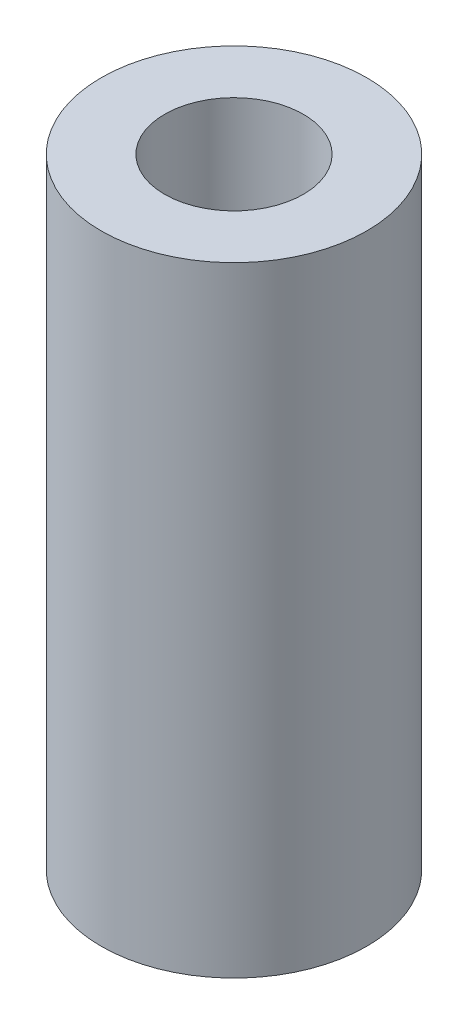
ISO-10303-21;
HEADER;
FILE_DESCRIPTION(('STEP AP214'),'2;1');
FILE_NAME('part.step','',(''),(''),'','','');
FILE_SCHEMA(('AUTOMOTIVE_DESIGN { 1 0 10303 214 1 1 1 1 }'));
ENDSEC;
DATA;
#1=APPLICATION_CONTEXT('core data for automotive mechanical design processes');
#2=APPLICATION_PROTOCOL_DEFINITION('international standard','automotive_design',2000,#1);
#3=PRODUCT_CONTEXT('',#1,'mechanical');
#4=PRODUCT('Part','Part','',(#3));
#5=PRODUCT_RELATED_PRODUCT_CATEGORY('part','',(#4));
#6=PRODUCT_DEFINITION_FORMATION('','',#4);
#7=PRODUCT_DEFINITION_CONTEXT('part definition',#1,'design');
#8=PRODUCT_DEFINITION('design','',#6,#7);
#9=PRODUCT_DEFINITION_SHAPE('','',#8);
#10=(LENGTH_UNIT() NAMED_UNIT(*) SI_UNIT(.MILLI.,.METRE.));
#11=(NAMED_UNIT(*) PLANE_ANGLE_UNIT() SI_UNIT($,.RADIAN.));
#12=(NAMED_UNIT(*) SI_UNIT($,.STERADIAN.) SOLID_ANGLE_UNIT());
#13=UNCERTAINTY_MEASURE_WITH_UNIT(LENGTH_MEASURE(1.E-05),#10,'distance_accuracy_value','');
#14=(GEOMETRIC_REPRESENTATION_CONTEXT(3) GLOBAL_UNCERTAINTY_ASSIGNED_CONTEXT((#13)) GLOBAL_UNIT_ASSIGNED_CONTEXT((#10,
#11,#12)) REPRESENTATION_CONTEXT('',''));
#15=CARTESIAN_POINT('',(0.,0.,0.));
#16=DIRECTION('',(0.,0.,1.));
#17=DIRECTION('',(1.,0.,0.));
#18=AXIS2_PLACEMENT_3D('',#15,#16,#17);
#19=CARTESIAN_POINT('',(0.,22.225,0.));
#20=DIRECTION('',(0.,1.,0.));
#21=DIRECTION('',(0.,0.,1.));
#22=AXIS2_PLACEMENT_3D('',#19,#20,#21);
#23=PLANE('',#22);
#24=CARTESIAN_POINT('',(0.,22.225,0.));
#25=DIRECTION('',(0.,1.,0.));
#26=DIRECTION('',(0.,0.,1.));
#27=AXIS2_PLACEMENT_3D('',#24,#25,#26);
#28=CIRCLE('',#27,4.7625);
#29=CARTESIAN_POINT('',(0.,22.225,4.7625));
#30=VERTEX_POINT('',#29);
#31=EDGE_CURVE('E10',#30,#30,#28,.T.);
#32=ORIENTED_EDGE('',*,*,#31,.T.);
#33=EDGE_LOOP('',(#32));
#34=FACE_BOUND('',#33,.T.);
#35=CARTESIAN_POINT('',(0.,22.225,0.));
#36=DIRECTION('',(0.,1.,0.));
#37=DIRECTION('',(0.,0.,1.));
#38=AXIS2_PLACEMENT_3D('',#35,#36,#37);
#39=CIRCLE('',#38,2.4892);
#40=CARTESIAN_POINT('',(0.,22.225,2.4892));
#41=VERTEX_POINT('',#40);
#42=EDGE_CURVE('E42',#41,#41,#39,.T.);
#43=ORIENTED_EDGE('',*,*,#42,.F.);
#44=EDGE_LOOP('',(#43));
#45=FACE_BOUND('',#44,.T.);
#46=ADVANCED_FACE('F31',(#34,#45),#23,.T.);
#47=CARTESIAN_POINT('',(0.,0.,0.));
#48=DIRECTION('',(0.,1.,0.));
#49=DIRECTION('',(0.,0.,1.));
#50=AXIS2_PLACEMENT_3D('',#47,#48,#49);
#51=PLANE('',#50);
#52=CARTESIAN_POINT('',(0.,0.,0.));
#53=DIRECTION('',(0.,1.,0.));
#54=DIRECTION('',(0.,0.,1.));
#55=AXIS2_PLACEMENT_3D('',#52,#53,#54);
#56=CIRCLE('',#55,4.7625);
#57=CARTESIAN_POINT('',(0.,0.,4.7625));
#58=VERTEX_POINT('',#57);
#59=EDGE_CURVE('E35',#58,#58,#56,.T.);
#60=ORIENTED_EDGE('',*,*,#59,.F.);
#61=EDGE_LOOP('',(#60));
#62=FACE_BOUND('',#61,.T.);
#63=CARTESIAN_POINT('',(0.,0.,0.));
#64=DIRECTION('',(0.,1.,0.));
#65=DIRECTION('',(0.,0.,1.));
#66=AXIS2_PLACEMENT_3D('',#63,#64,#65);
#67=CIRCLE('',#66,2.4892);
#68=CARTESIAN_POINT('',(0.,0.,2.4892));
#69=VERTEX_POINT('',#68);
#70=EDGE_CURVE('E44',#69,#69,#67,.T.);
#71=ORIENTED_EDGE('',*,*,#70,.T.);
#72=EDGE_LOOP('',(#71));
#73=FACE_BOUND('',#72,.T.);
#74=ADVANCED_FACE('F54',(#62,#73),#51,.F.);
#75=CARTESIAN_POINT('',(0.,22.225,0.));
#76=DIRECTION('',(0.,-1.,0.));
#77=DIRECTION('',(0.,0.,-1.));
#78=AXIS2_PLACEMENT_3D('',#75,#76,#77);
#79=CYLINDRICAL_SURFACE('',#78,4.7625);
#80=ORIENTED_EDGE('',*,*,#31,.F.);
#81=EDGE_LOOP('',(#80));
#82=FACE_BOUND('',#81,.T.);
#83=ORIENTED_EDGE('',*,*,#59,.T.);
#84=EDGE_LOOP('',(#83));
#85=FACE_BOUND('',#84,.T.);
#86=ADVANCED_FACE('F33',(#82,#85),#79,.T.);
#87=CARTESIAN_POINT('',(0.,22.225,0.));
#88=DIRECTION('',(0.,-1.,0.));
#89=DIRECTION('',(0.,0.,-1.));
#90=AXIS2_PLACEMENT_3D('',#87,#88,#89);
#91=CYLINDRICAL_SURFACE('',#90,2.4892);
#92=ORIENTED_EDGE('',*,*,#42,.T.);
#93=EDGE_LOOP('',(#92));
#94=FACE_BOUND('',#93,.T.);
#95=ORIENTED_EDGE('',*,*,#70,.F.);
#96=EDGE_LOOP('',(#95));
#97=FACE_BOUND('',#96,.T.);
#98=ADVANCED_FACE('F50',(#94,#97),#91,.F.);
#99=CLOSED_SHELL('',(#46,#74,#86,#98));
#100=MANIFOLD_SOLID_BREP('B2',#99);
#101=ADVANCED_BREP_SHAPE_REPRESENTATION('',(#18,#100),#14);
#102=SHAPE_DEFINITION_REPRESENTATION(#9,#101);
ENDSEC;
END-ISO-10303-21;
